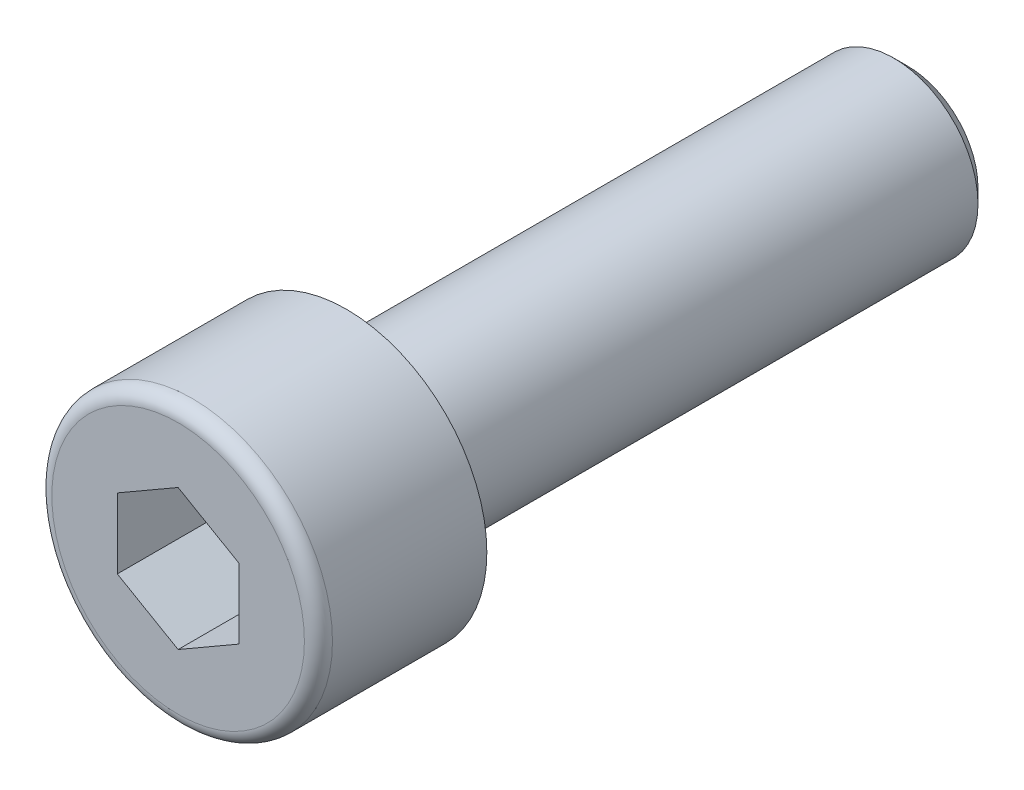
ISO-10303-21;
HEADER;
FILE_DESCRIPTION(('STEP AP214'),'2;1');
FILE_NAME('part.step','',(''),(''),'','','');
FILE_SCHEMA(('AUTOMOTIVE_DESIGN { 1 0 10303 214 1 1 1 1 }'));
ENDSEC;
DATA;
#1=APPLICATION_CONTEXT('core data for automotive mechanical design processes');
#2=APPLICATION_PROTOCOL_DEFINITION('international standard','automotive_design',2000,#1);
#3=PRODUCT_CONTEXT('',#1,'mechanical');
#4=PRODUCT('Part','Part','',(#3));
#5=PRODUCT_RELATED_PRODUCT_CATEGORY('part','',(#4));
#6=PRODUCT_DEFINITION_FORMATION('','',#4);
#7=PRODUCT_DEFINITION_CONTEXT('part definition',#1,'design');
#8=PRODUCT_DEFINITION('design','',#6,#7);
#9=PRODUCT_DEFINITION_SHAPE('','',#8);
#10=(LENGTH_UNIT() NAMED_UNIT(*) SI_UNIT(.MILLI.,.METRE.));
#11=(NAMED_UNIT(*) PLANE_ANGLE_UNIT() SI_UNIT($,.RADIAN.));
#12=(NAMED_UNIT(*) SI_UNIT($,.STERADIAN.) SOLID_ANGLE_UNIT());
#13=UNCERTAINTY_MEASURE_WITH_UNIT(LENGTH_MEASURE(1.E-05),#10,'distance_accuracy_value','');
#14=(GEOMETRIC_REPRESENTATION_CONTEXT(3) GLOBAL_UNCERTAINTY_ASSIGNED_CONTEXT((#13)) GLOBAL_UNIT_ASSIGNED_CONTEXT((#10,
#11,#12)) REPRESENTATION_CONTEXT('',''));
#15=CARTESIAN_POINT('',(0.,0.,0.));
#16=DIRECTION('',(0.,0.,1.));
#17=DIRECTION('',(1.,0.,0.));
#18=AXIS2_PLACEMENT_3D('',#15,#16,#17);
#19=CARTESIAN_POINT('',(0.,0.,20.));
#20=DIRECTION('',(0.,0.,-1.));
#21=DIRECTION('',(-1.,0.,0.));
#22=AXIS2_PLACEMENT_3D('',#19,#20,#21);
#23=CYLINDRICAL_SURFACE('',#22,3.);
#24=CARTESIAN_POINT('',(0.,0.,0.500000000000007));
#25=DIRECTION('',(0.,0.,1.));
#26=DIRECTION('',(1.,0.,0.));
#27=AXIS2_PLACEMENT_3D('',#24,#25,#26);
#28=CIRCLE('',#27,3.);
#29=CARTESIAN_POINT('',(3.,0.,0.500000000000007));
#30=VERTEX_POINT('',#29);
#31=EDGE_CURVE('E41',#30,#30,#28,.T.);
#32=ORIENTED_EDGE('',*,*,#31,.T.);
#33=EDGE_LOOP('',(#32));
#34=FACE_BOUND('',#33,.T.);
#35=CARTESIAN_POINT('',(0.,0.,20.));
#36=DIRECTION('',(0.,0.,1.));
#37=DIRECTION('',(1.,0.,0.));
#38=AXIS2_PLACEMENT_3D('',#35,#36,#37);
#39=CIRCLE('',#38,3.);
#40=CARTESIAN_POINT('',(3.,0.,20.));
#41=VERTEX_POINT('',#40);
#42=EDGE_CURVE('E144',#41,#41,#39,.T.);
#43=ORIENTED_EDGE('',*,*,#42,.F.);
#44=EDGE_LOOP('',(#43));
#45=FACE_BOUND('',#44,.T.);
#46=ADVANCED_FACE('F34',(#34,#45),#23,.T.);
#47=CARTESIAN_POINT('',(0.,0.,0.));
#48=DIRECTION('',(0.,0.,1.));
#49=DIRECTION('',(1.,0.,0.));
#50=AXIS2_PLACEMENT_3D('',#47,#48,#49);
#51=PLANE('',#50);
#52=CARTESIAN_POINT('',(0.,0.,0.));
#53=DIRECTION('',(0.,0.,1.));
#54=DIRECTION('',(1.,0.,0.));
#55=AXIS2_PLACEMENT_3D('',#52,#53,#54);
#56=CIRCLE('',#55,2.5);
#57=CARTESIAN_POINT('',(2.5,0.,0.));
#58=VERTEX_POINT('',#57);
#59=EDGE_CURVE('E11',#58,#58,#56,.F.);
#60=ORIENTED_EDGE('',*,*,#59,.T.);
#61=EDGE_LOOP('',(#60));
#62=FACE_BOUND('',#61,.T.);
#63=ADVANCED_FACE('F170',(#62),#51,.F.);
#64=CARTESIAN_POINT('',(0.,0.,20.));
#65=DIRECTION('',(0.,0.,1.));
#66=DIRECTION('',(1.,0.,0.));
#67=AXIS2_PLACEMENT_3D('',#64,#65,#66);
#68=PLANE('',#67);
#69=CARTESIAN_POINT('',(0.,0.,20.));
#70=DIRECTION('',(0.,0.,1.));
#71=DIRECTION('',(1.,0.,0.));
#72=AXIS2_PLACEMENT_3D('',#69,#70,#71);
#73=CIRCLE('',#72,5.);
#74=CARTESIAN_POINT('',(5.,0.,20.));
#75=VERTEX_POINT('',#74);
#76=EDGE_CURVE('E135',#75,#75,#73,.T.);
#77=ORIENTED_EDGE('',*,*,#76,.F.);
#78=EDGE_LOOP('',(#77));
#79=FACE_BOUND('',#78,.T.);
#80=ORIENTED_EDGE('',*,*,#42,.T.);
#81=EDGE_LOOP('',(#80));
#82=FACE_BOUND('',#81,.T.);
#83=ADVANCED_FACE('F174',(#79,#82),#68,.F.);
#84=CARTESIAN_POINT('',(0.,0.,26.));
#85=DIRECTION('',(0.,0.,-1.));
#86=DIRECTION('',(-1.,0.,0.));
#87=AXIS2_PLACEMENT_3D('',#84,#85,#86);
#88=CYLINDRICAL_SURFACE('',#87,5.);
#89=CARTESIAN_POINT('',(0.,0.,25.5));
#90=DIRECTION('',(0.,0.,1.));
#91=DIRECTION('',(1.,0.,0.));
#92=AXIS2_PLACEMENT_3D('',#89,#90,#91);
#93=CIRCLE('',#92,5.);
#94=CARTESIAN_POINT('',(5.,0.,25.5));
#95=VERTEX_POINT('',#94);
#96=EDGE_CURVE('E150',#95,#95,#93,.F.);
#97=ORIENTED_EDGE('',*,*,#96,.T.);
#98=EDGE_LOOP('',(#97));
#99=FACE_BOUND('',#98,.T.);
#100=ORIENTED_EDGE('',*,*,#76,.T.);
#101=EDGE_LOOP('',(#100));
#102=FACE_BOUND('',#101,.T.);
#103=ADVANCED_FACE('F179',(#99,#102),#88,.T.);
#104=CARTESIAN_POINT('',(0.,0.,26.));
#105=DIRECTION('',(0.,0.,1.));
#106=DIRECTION('',(1.,0.,0.));
#107=AXIS2_PLACEMENT_3D('',#104,#105,#106);
#108=PLANE('',#107);
#109=CARTESIAN_POINT('',(0.,0.,26.));
#110=DIRECTION('',(0.,0.,1.));
#111=DIRECTION('',(1.,0.,0.));
#112=AXIS2_PLACEMENT_3D('',#109,#110,#111);
#113=CIRCLE('',#112,4.5);
#114=CARTESIAN_POINT('',(4.5,0.,26.));
#115=VERTEX_POINT('',#114);
#116=EDGE_CURVE('E147',#115,#115,#113,.T.);
#117=ORIENTED_EDGE('',*,*,#116,.T.);
#118=EDGE_LOOP('',(#117));
#119=FACE_BOUND('',#118,.T.);
#120=DIRECTION('',(-0.866025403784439,0.5,0.));
#121=VECTOR('',#120,1.);
#122=CARTESIAN_POINT('',(2.1650635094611,1.25,26.));
#123=LINE('',#122,#121);
#124=CARTESIAN_POINT('',(2.1650635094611,1.25,26.));
#125=VERTEX_POINT('',#124);
#126=CARTESIAN_POINT('',(0.,2.5,26.));
#127=VERTEX_POINT('',#126);
#128=EDGE_CURVE('E48',#125,#127,#123,.T.);
#129=ORIENTED_EDGE('',*,*,#128,.F.);
#130=DIRECTION('',(0.,1.,0.));
#131=VECTOR('',#130,1.);
#132=CARTESIAN_POINT('',(2.1650635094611,-1.25,26.));
#133=LINE('',#132,#131);
#134=CARTESIAN_POINT('',(2.1650635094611,-1.25,26.));
#135=VERTEX_POINT('',#134);
#136=EDGE_CURVE('E117',#135,#125,#133,.T.);
#137=ORIENTED_EDGE('',*,*,#136,.F.);
#138=DIRECTION('',(0.866025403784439,0.5,0.));
#139=VECTOR('',#138,1.);
#140=CARTESIAN_POINT('',(0.,-2.5,26.));
#141=LINE('',#140,#139);
#142=CARTESIAN_POINT('',(0.,-2.5,26.));
#143=VERTEX_POINT('',#142);
#144=EDGE_CURVE('E111',#143,#135,#141,.T.);
#145=ORIENTED_EDGE('',*,*,#144,.F.);
#146=DIRECTION('',(0.866025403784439,-0.5,0.));
#147=VECTOR('',#146,1.);
#148=CARTESIAN_POINT('',(-2.1650635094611,-1.25,26.));
#149=LINE('',#148,#147);
#150=CARTESIAN_POINT('',(-2.1650635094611,-1.25,26.));
#151=VERTEX_POINT('',#150);
#152=EDGE_CURVE('E109',#151,#143,#149,.T.);
#153=ORIENTED_EDGE('',*,*,#152,.F.);
#154=DIRECTION('',(0.,-1.,0.));
#155=VECTOR('',#154,1.);
#156=CARTESIAN_POINT('',(-2.1650635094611,1.25,26.));
#157=LINE('',#156,#155);
#158=CARTESIAN_POINT('',(-2.1650635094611,1.25,26.));
#159=VERTEX_POINT('',#158);
#160=EDGE_CURVE('E91',#159,#151,#157,.T.);
#161=ORIENTED_EDGE('',*,*,#160,.F.);
#162=DIRECTION('',(-0.866025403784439,-0.5,0.));
#163=VECTOR('',#162,1.);
#164=CARTESIAN_POINT('',(0.,2.5,26.));
#165=LINE('',#164,#163);
#166=EDGE_CURVE('E102',#127,#159,#165,.T.);
#167=ORIENTED_EDGE('',*,*,#166,.F.);
#168=EDGE_LOOP('',(#129,#137,#145,#153,#161,#167));
#169=FACE_BOUND('',#168,.T.);
#170=ADVANCED_FACE('F106',(#119,#169),#108,.T.);
#171=CARTESIAN_POINT('',(2.1650635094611,1.25,22.5));
#172=DIRECTION('',(0.5,0.866025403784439,0.));
#173=DIRECTION('',(-0.866025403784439,0.5,0.));
#174=AXIS2_PLACEMENT_3D('',#171,#172,#173);
#175=PLANE('',#174);
#176=ORIENTED_EDGE('',*,*,#128,.T.);
#177=DIRECTION('',(0.,0.,1.));
#178=VECTOR('',#177,1.);
#179=CARTESIAN_POINT('',(0.,2.5,22.5));
#180=LINE('',#179,#178);
#181=CARTESIAN_POINT('',(0.,2.5,22.5));
#182=VERTEX_POINT('',#181);
#183=EDGE_CURVE('E99',#182,#127,#180,.T.);
#184=ORIENTED_EDGE('',*,*,#183,.F.);
#185=DIRECTION('',(-0.866025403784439,0.5,0.));
#186=VECTOR('',#185,1.);
#187=CARTESIAN_POINT('',(2.1650635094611,1.25,22.5));
#188=LINE('',#187,#186);
#189=CARTESIAN_POINT('',(2.1650635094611,1.25,22.5));
#190=VERTEX_POINT('',#189);
#191=EDGE_CURVE('E119',#190,#182,#188,.T.);
#192=ORIENTED_EDGE('',*,*,#191,.F.);
#193=DIRECTION('',(0.,0.,1.));
#194=VECTOR('',#193,1.);
#195=CARTESIAN_POINT('',(2.1650635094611,1.25,22.5));
#196=LINE('',#195,#194);
#197=EDGE_CURVE('E55',#190,#125,#196,.T.);
#198=ORIENTED_EDGE('',*,*,#197,.T.);
#199=EDGE_LOOP('',(#176,#184,#192,#198));
#200=FACE_BOUND('',#199,.T.);
#201=ADVANCED_FACE('F187',(#200),#175,.F.);
#202=CARTESIAN_POINT('',(2.1650635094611,-1.25,22.5));
#203=DIRECTION('',(1.,0.,0.));
#204=DIRECTION('',(0.,1.,0.));
#205=AXIS2_PLACEMENT_3D('',#202,#203,#204);
#206=PLANE('',#205);
#207=ORIENTED_EDGE('',*,*,#136,.T.);
#208=ORIENTED_EDGE('',*,*,#197,.F.);
#209=DIRECTION('',(0.,1.,0.));
#210=VECTOR('',#209,1.);
#211=CARTESIAN_POINT('',(2.1650635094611,-1.25,22.5));
#212=LINE('',#211,#210);
#213=CARTESIAN_POINT('',(2.1650635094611,-1.25,22.5));
#214=VERTEX_POINT('',#213);
#215=EDGE_CURVE('E131',#214,#190,#212,.T.);
#216=ORIENTED_EDGE('',*,*,#215,.F.);
#217=DIRECTION('',(0.,0.,1.));
#218=VECTOR('',#217,1.);
#219=CARTESIAN_POINT('',(2.1650635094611,-1.25,22.5));
#220=LINE('',#219,#218);
#221=EDGE_CURVE('E136',#214,#135,#220,.T.);
#222=ORIENTED_EDGE('',*,*,#221,.T.);
#223=EDGE_LOOP('',(#207,#208,#216,#222));
#224=FACE_BOUND('',#223,.T.);
#225=ADVANCED_FACE('F192',(#224),#206,.F.);
#226=CARTESIAN_POINT('',(0.,-2.5,22.5));
#227=DIRECTION('',(0.5,-0.866025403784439,0.));
#228=DIRECTION('',(0.866025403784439,0.5,0.));
#229=AXIS2_PLACEMENT_3D('',#226,#227,#228);
#230=PLANE('',#229);
#231=ORIENTED_EDGE('',*,*,#144,.T.);
#232=ORIENTED_EDGE('',*,*,#221,.F.);
#233=DIRECTION('',(0.866025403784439,0.5,0.));
#234=VECTOR('',#233,1.);
#235=CARTESIAN_POINT('',(0.,-2.5,22.5));
#236=LINE('',#235,#234);
#237=CARTESIAN_POINT('',(0.,-2.5,22.5));
#238=VERTEX_POINT('',#237);
#239=EDGE_CURVE('E128',#238,#214,#236,.T.);
#240=ORIENTED_EDGE('',*,*,#239,.F.);
#241=DIRECTION('',(0.,0.,1.));
#242=VECTOR('',#241,1.);
#243=CARTESIAN_POINT('',(0.,-2.5,22.5));
#244=LINE('',#243,#242);
#245=EDGE_CURVE('E138',#238,#143,#244,.T.);
#246=ORIENTED_EDGE('',*,*,#245,.T.);
#247=EDGE_LOOP('',(#231,#232,#240,#246));
#248=FACE_BOUND('',#247,.T.);
#249=ADVANCED_FACE('F200',(#248),#230,.F.);
#250=CARTESIAN_POINT('',(-2.1650635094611,-1.25,22.5));
#251=DIRECTION('',(-0.5,-0.866025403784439,0.));
#252=DIRECTION('',(0.866025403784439,-0.5,0.));
#253=AXIS2_PLACEMENT_3D('',#250,#251,#252);
#254=PLANE('',#253);
#255=ORIENTED_EDGE('',*,*,#152,.T.);
#256=ORIENTED_EDGE('',*,*,#245,.F.);
#257=DIRECTION('',(0.866025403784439,-0.5,0.));
#258=VECTOR('',#257,1.);
#259=CARTESIAN_POINT('',(-2.1650635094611,-1.25,22.5));
#260=LINE('',#259,#258);
#261=CARTESIAN_POINT('',(-2.1650635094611,-1.25,22.5));
#262=VERTEX_POINT('',#261);
#263=EDGE_CURVE('E125',#262,#238,#260,.T.);
#264=ORIENTED_EDGE('',*,*,#263,.F.);
#265=DIRECTION('',(0.,0.,1.));
#266=VECTOR('',#265,1.);
#267=CARTESIAN_POINT('',(-2.1650635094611,-1.25,22.5));
#268=LINE('',#267,#266);
#269=EDGE_CURVE('E98',#262,#151,#268,.T.);
#270=ORIENTED_EDGE('',*,*,#269,.T.);
#271=EDGE_LOOP('',(#255,#256,#264,#270));
#272=FACE_BOUND('',#271,.T.);
#273=ADVANCED_FACE('F197',(#272),#254,.F.);
#274=CARTESIAN_POINT('',(-2.1650635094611,1.25,22.5));
#275=DIRECTION('',(-1.,0.,0.));
#276=DIRECTION('',(0.,-1.,0.));
#277=AXIS2_PLACEMENT_3D('',#274,#275,#276);
#278=PLANE('',#277);
#279=ORIENTED_EDGE('',*,*,#160,.T.);
#280=ORIENTED_EDGE('',*,*,#269,.F.);
#281=DIRECTION('',(0.,-1.,0.));
#282=VECTOR('',#281,1.);
#283=CARTESIAN_POINT('',(-2.1650635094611,1.25,22.5));
#284=LINE('',#283,#282);
#285=CARTESIAN_POINT('',(-2.1650635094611,1.25,22.5));
#286=VERTEX_POINT('',#285);
#287=EDGE_CURVE('E94',#286,#262,#284,.T.);
#288=ORIENTED_EDGE('',*,*,#287,.F.);
#289=DIRECTION('',(0.,0.,1.));
#290=VECTOR('',#289,1.);
#291=CARTESIAN_POINT('',(-2.1650635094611,1.25,22.5));
#292=LINE('',#291,#290);
#293=EDGE_CURVE('E87',#286,#159,#292,.T.);
#294=ORIENTED_EDGE('',*,*,#293,.T.);
#295=EDGE_LOOP('',(#279,#280,#288,#294));
#296=FACE_BOUND('',#295,.T.);
#297=ADVANCED_FACE('F89',(#296),#278,.F.);
#298=CARTESIAN_POINT('',(0.,2.5,22.5));
#299=DIRECTION('',(-0.5,0.866025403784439,0.));
#300=DIRECTION('',(-0.866025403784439,-0.5,0.));
#301=AXIS2_PLACEMENT_3D('',#298,#299,#300);
#302=PLANE('',#301);
#303=ORIENTED_EDGE('',*,*,#166,.T.);
#304=ORIENTED_EDGE('',*,*,#293,.F.);
#305=DIRECTION('',(-0.866025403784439,-0.5,0.));
#306=VECTOR('',#305,1.);
#307=CARTESIAN_POINT('',(0.,2.5,22.5));
#308=LINE('',#307,#306);
#309=EDGE_CURVE('E122',#182,#286,#308,.T.);
#310=ORIENTED_EDGE('',*,*,#309,.F.);
#311=ORIENTED_EDGE('',*,*,#183,.T.);
#312=EDGE_LOOP('',(#303,#304,#310,#311));
#313=FACE_BOUND('',#312,.T.);
#314=ADVANCED_FACE('F103',(#313),#302,.F.);
#315=CARTESIAN_POINT('',(2.1650635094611,1.25,22.5));
#316=DIRECTION('',(0.,0.,-1.));
#317=DIRECTION('',(-1.,0.,0.));
#318=AXIS2_PLACEMENT_3D('',#315,#316,#317);
#319=PLANE('',#318);
#320=ORIENTED_EDGE('',*,*,#191,.T.);
#321=ORIENTED_EDGE('',*,*,#309,.T.);
#322=ORIENTED_EDGE('',*,*,#287,.T.);
#323=ORIENTED_EDGE('',*,*,#263,.T.);
#324=ORIENTED_EDGE('',*,*,#239,.T.);
#325=ORIENTED_EDGE('',*,*,#215,.T.);
#326=EDGE_LOOP('',(#320,#321,#322,#323,#324,#325));
#327=FACE_BOUND('',#326,.T.);
#328=ADVANCED_FACE('F165',(#327),#319,.F.);
#329=CARTESIAN_POINT('',(0.,0.,25.5));
#330=DIRECTION('',(0.,0.,1.));
#331=DIRECTION('',(1.,0.,0.));
#332=AXIS2_PLACEMENT_3D('',#329,#330,#331);
#333=TOROIDAL_SURFACE('',#332,4.5,0.5);
#334=ORIENTED_EDGE('',*,*,#96,.F.);
#335=EDGE_LOOP('',(#334));
#336=FACE_BOUND('',#335,.T.);
#337=ORIENTED_EDGE('',*,*,#116,.F.);
#338=EDGE_LOOP('',(#337));
#339=FACE_BOUND('',#338,.T.);
#340=ADVANCED_FACE('F159',(#336,#339),#333,.T.);
#341=CARTESIAN_POINT('',(0.,0.,0.500000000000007));
#342=DIRECTION('',(0.,0.,1.));
#343=DIRECTION('',(1.,0.,0.));
#344=AXIS2_PLACEMENT_3D('',#341,#342,#343);
#345=CONICAL_SURFACE('',#344,3.,0.785398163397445);
#346=ORIENTED_EDGE('',*,*,#59,.F.);
#347=EDGE_LOOP('',(#346));
#348=FACE_BOUND('',#347,.T.);
#349=ORIENTED_EDGE('',*,*,#31,.F.);
#350=EDGE_LOOP('',(#349));
#351=FACE_BOUND('',#350,.T.);
#352=ADVANCED_FACE('F157',(#348,#351),#345,.T.);
#353=CLOSED_SHELL('',(#46,#63,#83,#103,#170,#201,#225,#249,#273,#297,#314,#328,#340,#352));
#354=MANIFOLD_SOLID_BREP('B2',#353);
#355=ADVANCED_BREP_SHAPE_REPRESENTATION('',(#18,#354),#14);
#356=SHAPE_DEFINITION_REPRESENTATION(#9,#355);
ENDSEC;
END-ISO-10303-21;
